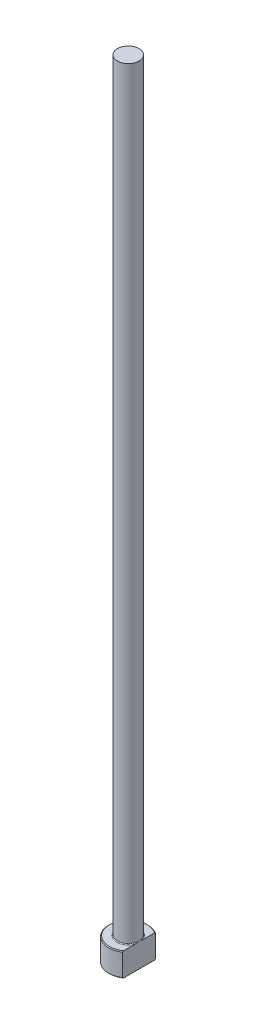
from build123d import *
from build123d.topology import SkipClean

# Parameters (mm, degrees)
CHAMFER1_SIZE    = 0.2
FILLET1_R        = 0.2
KEYED_HEAD_DEPTH = 201.124960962


with BuildPart() as part:
    # Sketch1 → Revolve1 (revolve)
    with BuildSketch(Plane.XY, mode=Mode.PRIVATE) as revolve1_sk:
        Polygon((0, 0), (-5, 0), (-5, 6), (-2.75, 6), (-2.75, 200), (0, 200), align=None)
    revolve(revolve1_sk.sketch.rotate(Axis((0, 259.958771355, 0), (0, -1, 0)), 270), axis=Axis((0, 259.958771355, 0), (0, -1, 0)))

    # Chamfer1
    chamfer1_edges = [part.edges().sort_by_distance(p)[0] for p in [
        (0, 6, -5),
        (0, 0, -5),
    ]]
    chamfer(chamfer1_edges, length=CHAMFER1_SIZE)

    # Fillet1
    fillet1_edges = [part.edges().sort_by_distance(p)[0] for p in [
        (0, 6, -2.75),
    ]]
    fillet(fillet1_edges, radius=FILLET1_R)

    # Sketch2 → KEYED HEAD (cut, through all)
    with SkipClean():  # the faces are left unmerged after this step: merging them gives an invalid solid
        with BuildSketch(Plane(origin=(0, 0, 0), x_dir=(1, 0, 0), z_dir=(0, 1, 0))):
            with BuildLine():
                Line((2.75, -4.175823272), (2.75, 4.175823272))
                ThreePointArc((2.75, 4.175823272), (5, 0), (2.75, -4.175823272))
            make_face()
        extrude(amount=KEYED_HEAD_DEPTH, mode=Mode.SUBTRACT)


solid = part.part
